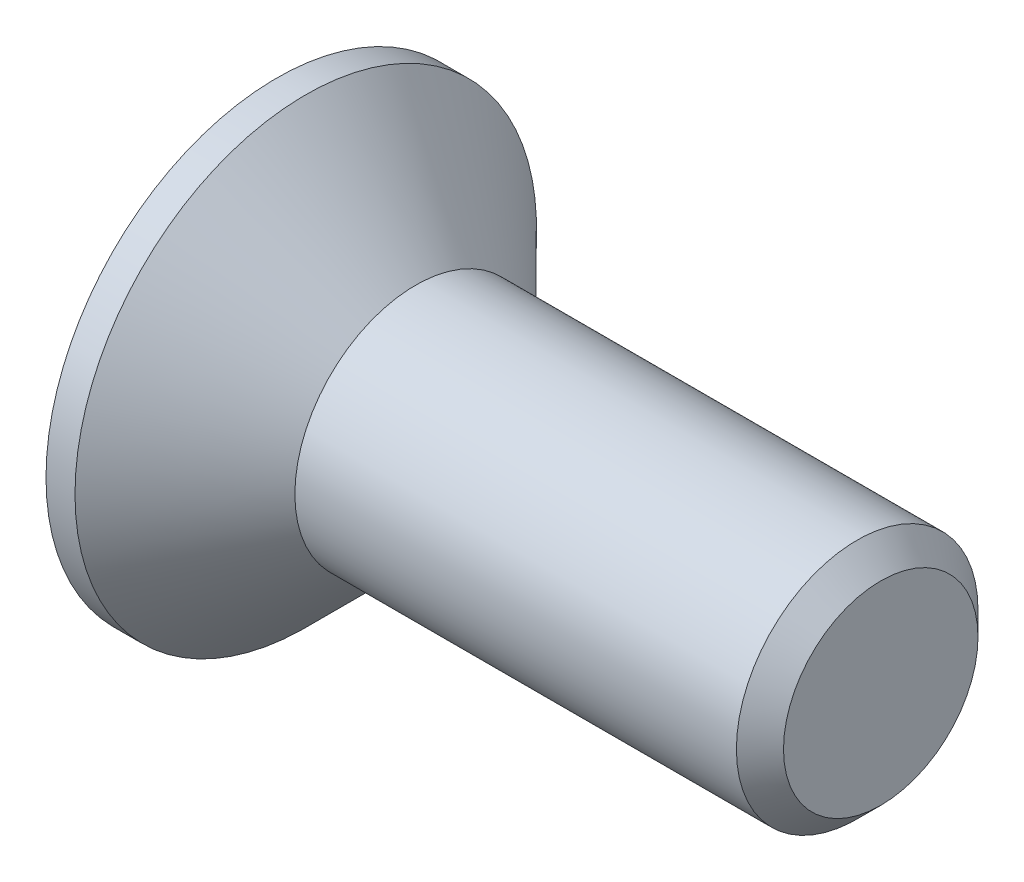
from build123d import *

# Parameters (mm, degrees)
HEX_2_DEPTH = 1.8


with BuildPart() as part:
    # BodySke → BaseBody (revolve)
    with BuildSketch(Plane.XY, mode=Mode.PRIVATE) as basebody_sk:
        Polygon((0, 0), (0, 3.82), (0.48, 3.82), (2.3, 2), (9.61, 2), (10, 1.61), (10, 0), align=None)
    revolve(basebody_sk.sketch.rotate(Axis((0, 0, 0), (1, 0, 0)), 90), axis=Axis((0, 0, 0), (1, 0, 0)))

    # Sketch3 → Hex 2 (cut)
    with BuildSketch(Plane.ZY):
        Polygon((-1.26, -0.727461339), (-1.26, 0.727461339), (0, 1.454922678), (1.26, 0.727461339), (1.26, -0.727461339), (0, -1.454922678), align=None)
    extrude(amount=-HEX_2_DEPTH, mode=Mode.SUBTRACT)


solid = part.part
